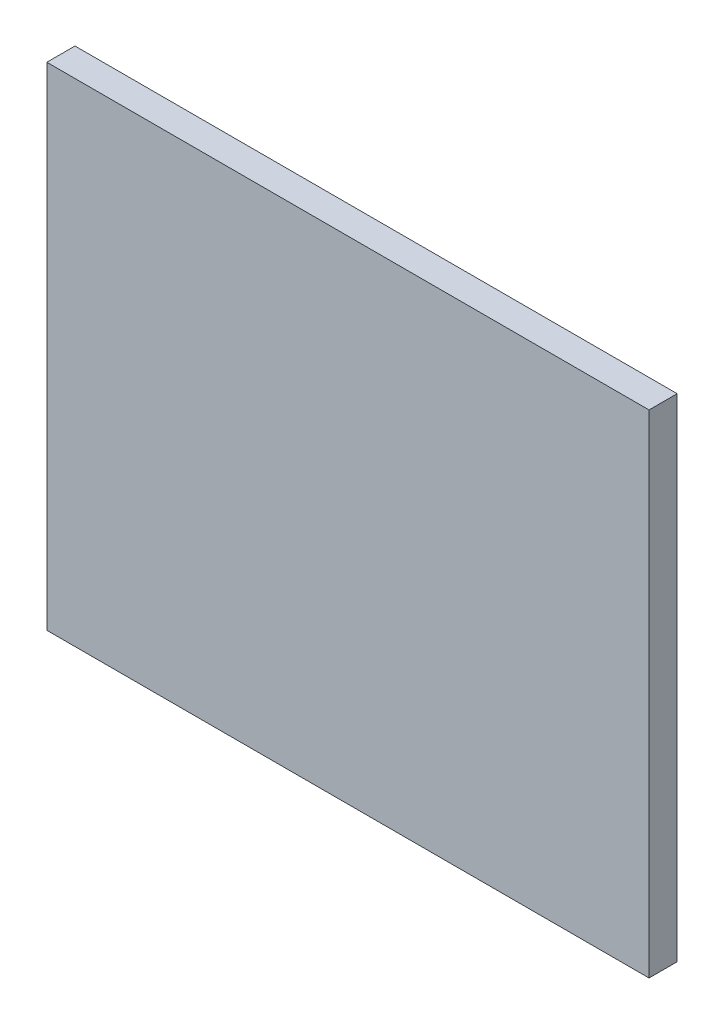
from build123d import *

# Parameters (mm, degrees)
SKIZZE1_W               = 107.002146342
SKIZZE1_H               = 87.413170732
LINEAR_AUSTRAGEN1_DEPTH = 5


with BuildPart() as part:
    # Skizze1 → Linear austragen1 (new body)
    with BuildSketch(Plane.XY):
        with Locations((1.895707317, -5.476487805)):
            Rectangle(SKIZZE1_W, SKIZZE1_H)
    extrude(amount=LINEAR_AUSTRAGEN1_DEPTH)


solid = part.part
